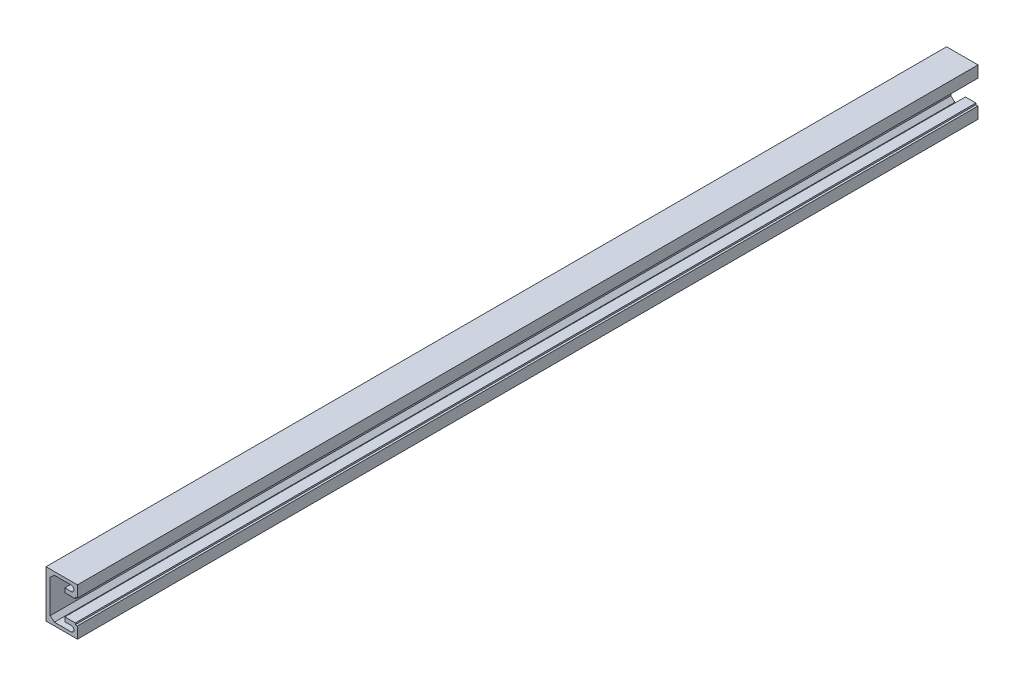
from build123d import *

# Parameters (mm, degrees)
BOSS_EXTRUDE1_DEPTH = 430


with BuildPart() as part:
    # Sketch1 → Boss-Extrude1 (new body)
    with BuildSketch(Plane.XY):
        with BuildLine():
            Line((0, 11.25), (0, -11.25))
            Line((0, -11.25), (15, -11.25))
            Line((15, -11.25), (15, -5.75))
            Line((15, -5.75), (14, -5.75))
            Line((14, -5.75), (14, -5))
            Line((14, -5), (9, -5))
            Line((9, -5), (9, -7.004716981))
            Line((9, -7.004716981), (12, -7.004716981))
            ThreePointArc((12, -7.004716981), (13.344339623, -8.349056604), (12, -9.693396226))
            Line((12, -9.693396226), (4, -9.693396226))
            Line((4, -9.693396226), (2, -8))
            Line((2, -8), (2, 8))
            Line((2, 8), (4, 9.693396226))
            Line((4, 9.693396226), (12, 9.693396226))
            ThreePointArc((12, 9.693396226), (13.344339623, 8.349056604), (12, 7.004716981))
            Line((12, 7.004716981), (9, 7.004716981))
            Line((9, 7.004716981), (9, 5))
            Line((9, 5), (14, 5))
            Line((14, 5), (14, 5.75))
            Line((14, 5.75), (15, 5.75))
            Line((15, 5.75), (15, 11.25))
            Line((15, 11.25), (0, 11.25))
        make_face()
    extrude(amount=BOSS_EXTRUDE1_DEPTH)


solid = part.part
